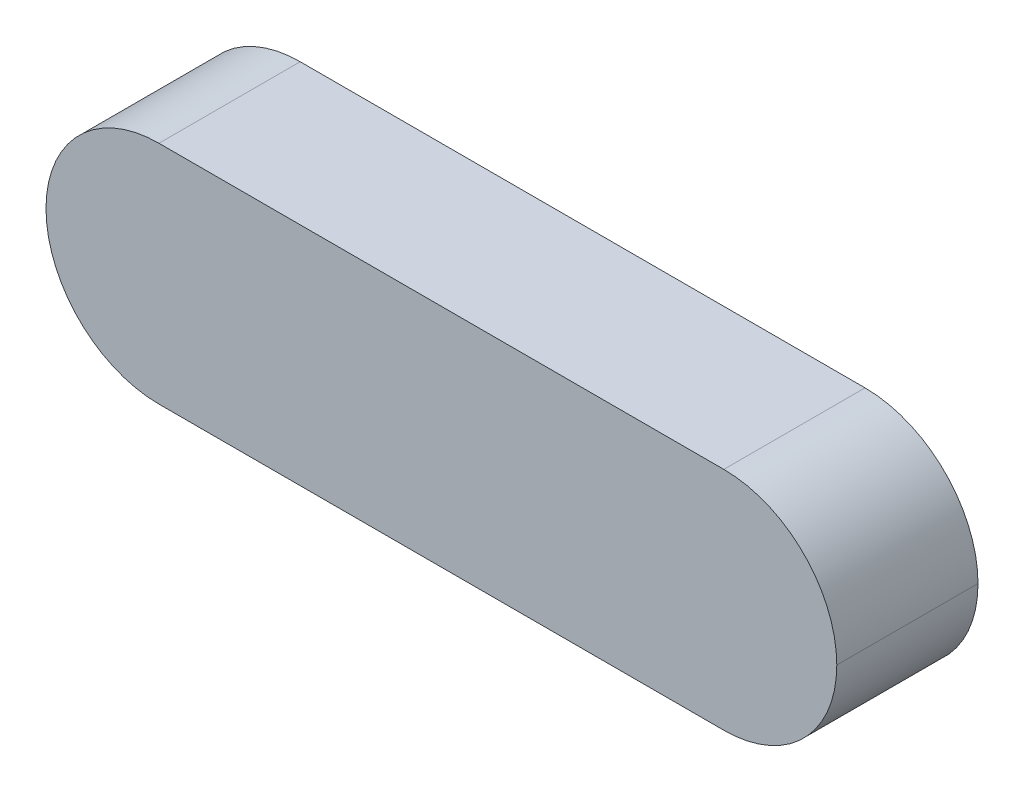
ISO-10303-21;
HEADER;
FILE_DESCRIPTION(('STEP AP214'),'2;1');
FILE_NAME('part.step','',(''),(''),'','','');
FILE_SCHEMA(('AUTOMOTIVE_DESIGN { 1 0 10303 214 1 1 1 1 }'));
ENDSEC;
DATA;
#1=APPLICATION_CONTEXT('core data for automotive mechanical design processes');
#2=APPLICATION_PROTOCOL_DEFINITION('international standard','automotive_design',2000,#1);
#3=PRODUCT_CONTEXT('',#1,'mechanical');
#4=PRODUCT('Part','Part','',(#3));
#5=PRODUCT_RELATED_PRODUCT_CATEGORY('part','',(#4));
#6=PRODUCT_DEFINITION_FORMATION('','',#4);
#7=PRODUCT_DEFINITION_CONTEXT('part definition',#1,'design');
#8=PRODUCT_DEFINITION('design','',#6,#7);
#9=PRODUCT_DEFINITION_SHAPE('','',#8);
#10=(LENGTH_UNIT() NAMED_UNIT(*) SI_UNIT(.MILLI.,.METRE.));
#11=(NAMED_UNIT(*) PLANE_ANGLE_UNIT() SI_UNIT($,.RADIAN.));
#12=(NAMED_UNIT(*) SI_UNIT($,.STERADIAN.) SOLID_ANGLE_UNIT());
#13=UNCERTAINTY_MEASURE_WITH_UNIT(LENGTH_MEASURE(1.E-05),#10,'distance_accuracy_value','');
#14=(GEOMETRIC_REPRESENTATION_CONTEXT(3) GLOBAL_UNCERTAINTY_ASSIGNED_CONTEXT((#13)) GLOBAL_UNIT_ASSIGNED_CONTEXT((#10,
#11,#12)) REPRESENTATION_CONTEXT('',''));
#15=CARTESIAN_POINT('',(0.,0.,0.));
#16=DIRECTION('',(0.,0.,1.));
#17=DIRECTION('',(1.,0.,0.));
#18=AXIS2_PLACEMENT_3D('',#15,#16,#17);
#19=CARTESIAN_POINT('',(28.,8.00000000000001,10.));
#20=DIRECTION('',(0.,-1.,0.));
#21=DIRECTION('',(1.,0.,0.));
#22=AXIS2_PLACEMENT_3D('',#19,#20,#21);
#23=PLANE('',#22);
#24=DIRECTION('',(-1.,0.,0.));
#25=VECTOR('',#24,1.);
#26=CARTESIAN_POINT('',(28.,8.00000000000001,0.));
#27=LINE('',#26,#25);
#28=CARTESIAN_POINT('',(20.,8.,0.));
#29=VERTEX_POINT('',#28);
#30=CARTESIAN_POINT('',(-20.,8.,0.));
#31=VERTEX_POINT('',#30);
#32=EDGE_CURVE('E111',#29,#31,#27,.T.);
#33=ORIENTED_EDGE('',*,*,#32,.T.);
#34=DIRECTION('',(0.,0.,-1.));
#35=VECTOR('',#34,1.);
#36=CARTESIAN_POINT('',(-20.,8.,10.));
#37=LINE('',#36,#35);
#38=CARTESIAN_POINT('',(-20.,8.,10.));
#39=VERTEX_POINT('',#38);
#40=EDGE_CURVE('E11',#31,#39,#37,.F.);
#41=ORIENTED_EDGE('',*,*,#40,.T.);
#42=DIRECTION('',(-1.,0.,0.));
#43=VECTOR('',#42,1.);
#44=CARTESIAN_POINT('',(28.,8.00000000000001,10.));
#45=LINE('',#44,#43);
#46=CARTESIAN_POINT('',(20.,8.,10.));
#47=VERTEX_POINT('',#46);
#48=EDGE_CURVE('E110',#47,#39,#45,.T.);
#49=ORIENTED_EDGE('',*,*,#48,.F.);
#50=DIRECTION('',(0.,0.,-1.));
#51=VECTOR('',#50,1.);
#52=CARTESIAN_POINT('',(20.,8.,10.));
#53=LINE('',#52,#51);
#54=EDGE_CURVE('E42',#47,#29,#53,.T.);
#55=ORIENTED_EDGE('',*,*,#54,.T.);
#56=EDGE_LOOP('',(#33,#41,#49,#55));
#57=FACE_BOUND('',#56,.T.);
#58=ADVANCED_FACE('F33',(#57),#23,.F.);
#59=CARTESIAN_POINT('',(28.,-8.,10.));
#60=DIRECTION('',(0.,-1.,0.));
#61=DIRECTION('',(1.,0.,0.));
#62=AXIS2_PLACEMENT_3D('',#59,#60,#61);
#63=PLANE('',#62);
#64=DIRECTION('',(-1.,0.,0.));
#65=VECTOR('',#64,1.);
#66=CARTESIAN_POINT('',(28.,-8.,10.));
#67=LINE('',#66,#65);
#68=CARTESIAN_POINT('',(20.,-8.,10.));
#69=VERTEX_POINT('',#68);
#70=CARTESIAN_POINT('',(-20.,-8.,10.));
#71=VERTEX_POINT('',#70);
#72=EDGE_CURVE('E115',#69,#71,#67,.T.);
#73=ORIENTED_EDGE('',*,*,#72,.T.);
#74=DIRECTION('',(0.,0.,-1.));
#75=VECTOR('',#74,1.);
#76=CARTESIAN_POINT('',(-20.,-8.,10.));
#77=LINE('',#76,#75);
#78=CARTESIAN_POINT('',(-20.,-8.,0.));
#79=VERTEX_POINT('',#78);
#80=EDGE_CURVE('E109',#71,#79,#77,.T.);
#81=ORIENTED_EDGE('',*,*,#80,.T.);
#82=DIRECTION('',(-1.,0.,0.));
#83=VECTOR('',#82,1.);
#84=CARTESIAN_POINT('',(28.,-8.,0.));
#85=LINE('',#84,#83);
#86=CARTESIAN_POINT('',(20.,-8.,0.));
#87=VERTEX_POINT('',#86);
#88=EDGE_CURVE('E91',#87,#79,#85,.T.);
#89=ORIENTED_EDGE('',*,*,#88,.F.);
#90=DIRECTION('',(0.,0.,-1.));
#91=VECTOR('',#90,1.);
#92=CARTESIAN_POINT('',(20.,-8.,10.));
#93=LINE('',#92,#91);
#94=EDGE_CURVE('E106',#87,#69,#93,.F.);
#95=ORIENTED_EDGE('',*,*,#94,.T.);
#96=EDGE_LOOP('',(#73,#81,#89,#95));
#97=FACE_BOUND('',#96,.T.);
#98=ADVANCED_FACE('F105',(#97),#63,.T.);
#99=CARTESIAN_POINT('',(0.,0.,10.));
#100=DIRECTION('',(0.,0.,1.));
#101=DIRECTION('',(1.,0.,0.));
#102=AXIS2_PLACEMENT_3D('',#99,#100,#101);
#103=PLANE('',#102);
#104=CARTESIAN_POINT('',(-20.,0.,10.));
#105=DIRECTION('',(0.,0.,1.));
#106=DIRECTION('',(1.,0.,0.));
#107=AXIS2_PLACEMENT_3D('',#104,#105,#106);
#108=CIRCLE('',#107,8.);
#109=CARTESIAN_POINT('',(-28.,0.,10.));
#110=VERTEX_POINT('',#109);
#111=EDGE_CURVE('E50',#39,#110,#108,.T.);
#112=ORIENTED_EDGE('',*,*,#111,.T.);
#113=CARTESIAN_POINT('',(-20.,0.,10.));
#114=DIRECTION('',(0.,0.,1.));
#115=DIRECTION('',(1.,0.,0.));
#116=AXIS2_PLACEMENT_3D('',#113,#114,#115);
#117=CIRCLE('',#116,8.);
#118=EDGE_CURVE('E129',#110,#71,#117,.T.);
#119=ORIENTED_EDGE('',*,*,#118,.T.);
#120=ORIENTED_EDGE('',*,*,#72,.F.);
#121=CARTESIAN_POINT('',(20.,0.,10.));
#122=DIRECTION('',(0.,0.,1.));
#123=DIRECTION('',(1.,0.,0.));
#124=AXIS2_PLACEMENT_3D('',#121,#122,#123);
#125=CIRCLE('',#124,8.);
#126=CARTESIAN_POINT('',(28.,0.,10.));
#127=VERTEX_POINT('',#126);
#128=EDGE_CURVE('E114',#69,#127,#125,.T.);
#129=ORIENTED_EDGE('',*,*,#128,.T.);
#130=CARTESIAN_POINT('',(20.,0.,10.));
#131=DIRECTION('',(0.,0.,1.));
#132=DIRECTION('',(1.,0.,0.));
#133=AXIS2_PLACEMENT_3D('',#130,#131,#132);
#134=CIRCLE('',#133,8.);
#135=EDGE_CURVE('E125',#127,#47,#134,.T.);
#136=ORIENTED_EDGE('',*,*,#135,.T.);
#137=ORIENTED_EDGE('',*,*,#48,.T.);
#138=EDGE_LOOP('',(#112,#119,#120,#129,#136,#137));
#139=FACE_BOUND('',#138,.T.);
#140=ADVANCED_FACE('F138',(#139),#103,.T.);
#141=CARTESIAN_POINT('',(0.,0.,0.));
#142=DIRECTION('',(0.,0.,1.));
#143=DIRECTION('',(1.,0.,0.));
#144=AXIS2_PLACEMENT_3D('',#141,#142,#143);
#145=PLANE('',#144);
#146=ORIENTED_EDGE('',*,*,#88,.T.);
#147=CARTESIAN_POINT('',(-20.,0.,0.));
#148=DIRECTION('',(0.,0.,1.));
#149=DIRECTION('',(1.,0.,0.));
#150=AXIS2_PLACEMENT_3D('',#147,#148,#149);
#151=CIRCLE('',#150,8.);
#152=CARTESIAN_POINT('',(-28.,0.,0.));
#153=VERTEX_POINT('',#152);
#154=EDGE_CURVE('E123',#79,#153,#151,.F.);
#155=ORIENTED_EDGE('',*,*,#154,.T.);
#156=CARTESIAN_POINT('',(-20.,0.,0.));
#157=DIRECTION('',(0.,0.,1.));
#158=DIRECTION('',(1.,0.,0.));
#159=AXIS2_PLACEMENT_3D('',#156,#157,#158);
#160=CIRCLE('',#159,8.);
#161=EDGE_CURVE('E99',#153,#31,#160,.F.);
#162=ORIENTED_EDGE('',*,*,#161,.T.);
#163=ORIENTED_EDGE('',*,*,#32,.F.);
#164=CARTESIAN_POINT('',(20.,0.,0.));
#165=DIRECTION('',(0.,0.,1.));
#166=DIRECTION('',(1.,0.,0.));
#167=AXIS2_PLACEMENT_3D('',#164,#165,#166);
#168=CIRCLE('',#167,8.);
#169=CARTESIAN_POINT('',(28.,0.,0.));
#170=VERTEX_POINT('',#169);
#171=EDGE_CURVE('E94',#29,#170,#168,.F.);
#172=ORIENTED_EDGE('',*,*,#171,.T.);
#173=CARTESIAN_POINT('',(20.,0.,0.));
#174=DIRECTION('',(0.,0.,1.));
#175=DIRECTION('',(1.,0.,0.));
#176=AXIS2_PLACEMENT_3D('',#173,#174,#175);
#177=CIRCLE('',#176,8.);
#178=EDGE_CURVE('E88',#170,#87,#177,.F.);
#179=ORIENTED_EDGE('',*,*,#178,.T.);
#180=EDGE_LOOP('',(#146,#155,#162,#163,#172,#179));
#181=FACE_BOUND('',#180,.T.);
#182=ADVANCED_FACE('F90',(#181),#145,.F.);
#183=CARTESIAN_POINT('',(-20.,0.,10.));
#184=DIRECTION('',(0.,0.,1.));
#185=DIRECTION('',(1.,0.,0.));
#186=AXIS2_PLACEMENT_3D('',#183,#184,#185);
#187=CYLINDRICAL_SURFACE('',#186,8.);
#188=DIRECTION('',(0.,0.,-1.));
#189=VECTOR('',#188,1.);
#190=CARTESIAN_POINT('',(-28.,0.,0.));
#191=LINE('',#190,#189);
#192=EDGE_CURVE('E131',#110,#153,#191,.T.);
#193=ORIENTED_EDGE('',*,*,#192,.F.);
#194=ORIENTED_EDGE('',*,*,#111,.F.);
#195=ORIENTED_EDGE('',*,*,#40,.F.);
#196=ORIENTED_EDGE('',*,*,#161,.F.);
#197=EDGE_LOOP('',(#193,#194,#195,#196));
#198=FACE_BOUND('',#197,.T.);
#199=ADVANCED_FACE('F142',(#198),#187,.T.);
#200=CARTESIAN_POINT('',(-20.,0.,10.));
#201=DIRECTION('',(0.,0.,-1.));
#202=DIRECTION('',(-1.,0.,0.));
#203=AXIS2_PLACEMENT_3D('',#200,#201,#202);
#204=CYLINDRICAL_SURFACE('',#203,8.);
#205=ORIENTED_EDGE('',*,*,#118,.F.);
#206=ORIENTED_EDGE('',*,*,#192,.T.);
#207=ORIENTED_EDGE('',*,*,#154,.F.);
#208=ORIENTED_EDGE('',*,*,#80,.F.);
#209=EDGE_LOOP('',(#205,#206,#207,#208));
#210=FACE_BOUND('',#209,.T.);
#211=ADVANCED_FACE('F143',(#210),#204,.T.);
#212=CARTESIAN_POINT('',(20.,0.,10.));
#213=DIRECTION('',(0.,0.,-1.));
#214=DIRECTION('',(-1.,0.,0.));
#215=AXIS2_PLACEMENT_3D('',#212,#213,#214);
#216=CYLINDRICAL_SURFACE('',#215,8.);
#217=ORIENTED_EDGE('',*,*,#54,.F.);
#218=ORIENTED_EDGE('',*,*,#135,.F.);
#219=DIRECTION('',(0.,0.,-1.));
#220=VECTOR('',#219,1.);
#221=CARTESIAN_POINT('',(28.,0.,10.));
#222=LINE('',#221,#220);
#223=EDGE_CURVE('E37',#170,#127,#222,.F.);
#224=ORIENTED_EDGE('',*,*,#223,.F.);
#225=ORIENTED_EDGE('',*,*,#171,.F.);
#226=EDGE_LOOP('',(#217,#218,#224,#225));
#227=FACE_BOUND('',#226,.T.);
#228=ADVANCED_FACE('F35',(#227),#216,.T.);
#229=CARTESIAN_POINT('',(20.,0.,10.));
#230=DIRECTION('',(0.,0.,1.));
#231=DIRECTION('',(1.,0.,0.));
#232=AXIS2_PLACEMENT_3D('',#229,#230,#231);
#233=CYLINDRICAL_SURFACE('',#232,8.);
#234=ORIENTED_EDGE('',*,*,#128,.F.);
#235=ORIENTED_EDGE('',*,*,#94,.F.);
#236=ORIENTED_EDGE('',*,*,#178,.F.);
#237=ORIENTED_EDGE('',*,*,#223,.T.);
#238=EDGE_LOOP('',(#234,#235,#236,#237));
#239=FACE_BOUND('',#238,.T.);
#240=ADVANCED_FACE('F113',(#239),#233,.T.);
#241=CLOSED_SHELL('',(#58,#98,#140,#182,#199,#211,#228,#240));
#242=MANIFOLD_SOLID_BREP('B2',#241);
#243=ADVANCED_BREP_SHAPE_REPRESENTATION('',(#18,#242),#14);
#244=SHAPE_DEFINITION_REPRESENTATION(#9,#243);
ENDSEC;
END-ISO-10303-21;
